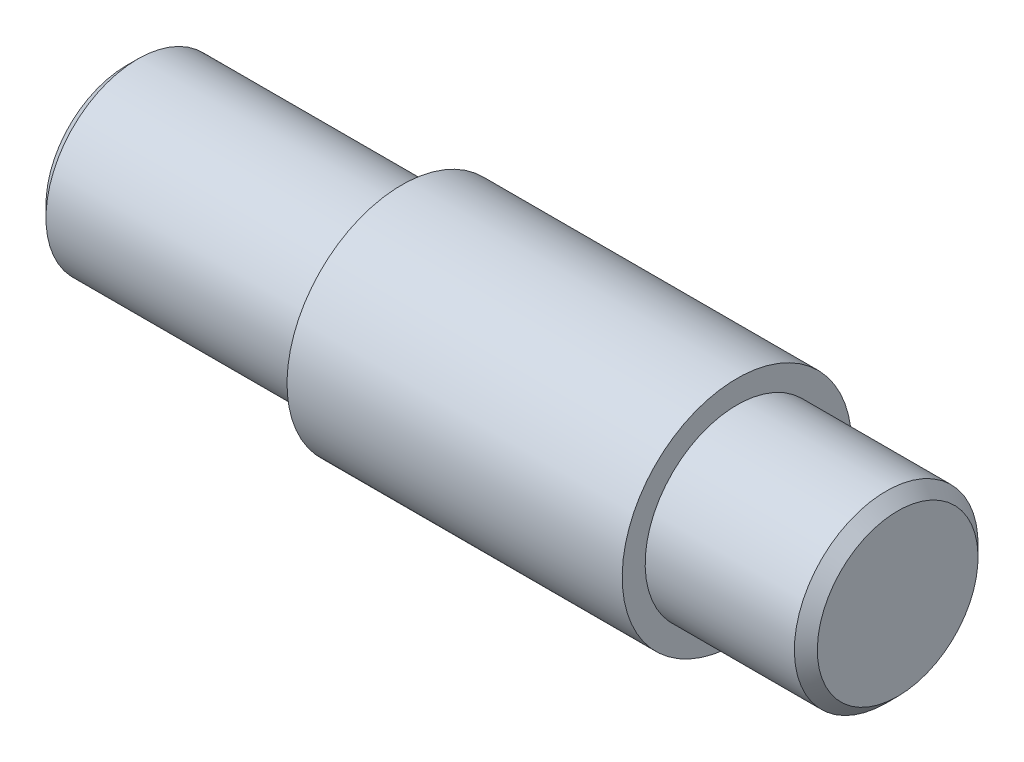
ISO-10303-21;
HEADER;
FILE_DESCRIPTION(('STEP AP214'),'2;1');
FILE_NAME('part.step','',(''),(''),'','','');
FILE_SCHEMA(('AUTOMOTIVE_DESIGN { 1 0 10303 214 1 1 1 1 }'));
ENDSEC;
DATA;
#1=APPLICATION_CONTEXT('core data for automotive mechanical design processes');
#2=APPLICATION_PROTOCOL_DEFINITION('international standard','automotive_design',2000,#1);
#3=PRODUCT_CONTEXT('',#1,'mechanical');
#4=PRODUCT('Part','Part','',(#3));
#5=PRODUCT_RELATED_PRODUCT_CATEGORY('part','',(#4));
#6=PRODUCT_DEFINITION_FORMATION('','',#4);
#7=PRODUCT_DEFINITION_CONTEXT('part definition',#1,'design');
#8=PRODUCT_DEFINITION('design','',#6,#7);
#9=PRODUCT_DEFINITION_SHAPE('','',#8);
#10=(LENGTH_UNIT() NAMED_UNIT(*) SI_UNIT(.MILLI.,.METRE.));
#11=(NAMED_UNIT(*) PLANE_ANGLE_UNIT() SI_UNIT($,.RADIAN.));
#12=(NAMED_UNIT(*) SI_UNIT($,.STERADIAN.) SOLID_ANGLE_UNIT());
#13=UNCERTAINTY_MEASURE_WITH_UNIT(LENGTH_MEASURE(1.E-05),#10,'distance_accuracy_value','');
#14=(GEOMETRIC_REPRESENTATION_CONTEXT(3) GLOBAL_UNCERTAINTY_ASSIGNED_CONTEXT((#13)) GLOBAL_UNIT_ASSIGNED_CONTEXT((#10,
#11,#12)) REPRESENTATION_CONTEXT('',''));
#15=CARTESIAN_POINT('',(0.,0.,0.));
#16=DIRECTION('',(0.,0.,1.));
#17=DIRECTION('',(1.,0.,0.));
#18=AXIS2_PLACEMENT_3D('',#15,#16,#17);
#19=CARTESIAN_POINT('',(0.,2.,0.));
#20=DIRECTION('',(1.,0.,0.));
#21=DIRECTION('',(0.,1.,0.));
#22=AXIS2_PLACEMENT_3D('',#19,#20,#21);
#23=PLANE('',#22);
#24=CARTESIAN_POINT('',(0.,0.,0.));
#25=DIRECTION('',(1.,0.,0.));
#26=DIRECTION('',(0.,1.,0.));
#27=AXIS2_PLACEMENT_3D('',#24,#25,#26);
#28=CIRCLE('',#27,1.75);
#29=CARTESIAN_POINT('',(0.,1.75,0.));
#30=VERTEX_POINT('',#29);
#31=EDGE_CURVE('E37',#30,#30,#28,.F.);
#32=ORIENTED_EDGE('',*,*,#31,.T.);
#33=EDGE_LOOP('',(#32));
#34=FACE_BOUND('',#33,.T.);
#35=CARTESIAN_POINT('',(0.,0.,0.));
#36=DIRECTION('',(-1.,0.,0.));
#37=DIRECTION('',(0.,0.,1.));
#38=AXIS2_PLACEMENT_3D('',#35,#36,#37);
#39=CIRCLE('',#38,0.5);
#40=CARTESIAN_POINT('',(0.,0.,0.5));
#41=VERTEX_POINT('',#40);
#42=EDGE_CURVE('E65',#41,#41,#39,.T.);
#43=ORIENTED_EDGE('',*,*,#42,.F.);
#44=EDGE_LOOP('',(#43));
#45=FACE_BOUND('',#44,.T.);
#46=ADVANCED_FACE('F31',(#34,#45),#23,.F.);
#47=CARTESIAN_POINT('',(16.8,0.,0.));
#48=DIRECTION('',(-1.,0.,0.));
#49=DIRECTION('',(0.,-1.,0.));
#50=AXIS2_PLACEMENT_3D('',#47,#48,#49);
#51=PLANE('',#50);
#52=CARTESIAN_POINT('',(16.8,0.,0.));
#53=DIRECTION('',(-1.,0.,0.));
#54=DIRECTION('',(0.,-1.,0.));
#55=AXIS2_PLACEMENT_3D('',#52,#53,#54);
#56=CIRCLE('',#55,1.74999999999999);
#57=CARTESIAN_POINT('',(16.8,-1.74999999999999,0.));
#58=VERTEX_POINT('',#57);
#59=EDGE_CURVE('E41',#58,#58,#56,.F.);
#60=ORIENTED_EDGE('',*,*,#59,.T.);
#61=EDGE_LOOP('',(#60));
#62=FACE_BOUND('',#61,.T.);
#63=ADVANCED_FACE('F72',(#62),#51,.F.);
#64=CARTESIAN_POINT('',(0.,0.,0.));
#65=DIRECTION('',(-1.,0.,0.));
#66=DIRECTION('',(0.,-1.,0.));
#67=AXIS2_PLACEMENT_3D('',#64,#65,#66);
#68=CYLINDRICAL_SURFACE('',#67,2.);
#69=CARTESIAN_POINT('',(16.55,0.,0.));
#70=DIRECTION('',(-1.,0.,0.));
#71=DIRECTION('',(0.,-1.,0.));
#72=AXIS2_PLACEMENT_3D('',#69,#70,#71);
#73=CIRCLE('',#72,2.);
#74=CARTESIAN_POINT('',(16.55,-2.,0.));
#75=VERTEX_POINT('',#74);
#76=EDGE_CURVE('E45',#75,#75,#73,.T.);
#77=ORIENTED_EDGE('',*,*,#76,.T.);
#78=EDGE_LOOP('',(#77));
#79=FACE_BOUND('',#78,.T.);
#80=CARTESIAN_POINT('',(13.3,0.,0.));
#81=DIRECTION('',(-1.,0.,0.));
#82=DIRECTION('',(0.,-1.,0.));
#83=AXIS2_PLACEMENT_3D('',#80,#81,#82);
#84=CIRCLE('',#83,2.);
#85=CARTESIAN_POINT('',(13.3,-2.,0.));
#86=VERTEX_POINT('',#85);
#87=EDGE_CURVE('E50',#86,#86,#84,.T.);
#88=ORIENTED_EDGE('',*,*,#87,.F.);
#89=EDGE_LOOP('',(#88));
#90=FACE_BOUND('',#89,.T.);
#91=ADVANCED_FACE('F76',(#79,#90),#68,.T.);
#92=CARTESIAN_POINT('',(13.3,2.,0.));
#93=DIRECTION('',(-1.,0.,0.));
#94=DIRECTION('',(0.,-1.,0.));
#95=AXIS2_PLACEMENT_3D('',#92,#93,#94);
#96=PLANE('',#95);
#97=CARTESIAN_POINT('',(13.3,0.,0.));
#98=DIRECTION('',(-1.,0.,0.));
#99=DIRECTION('',(0.,-1.,0.));
#100=AXIS2_PLACEMENT_3D('',#97,#98,#99);
#101=CIRCLE('',#100,2.5);
#102=CARTESIAN_POINT('',(13.3,-2.5,0.));
#103=VERTEX_POINT('',#102);
#104=EDGE_CURVE('E53',#103,#103,#101,.T.);
#105=ORIENTED_EDGE('',*,*,#104,.F.);
#106=EDGE_LOOP('',(#105));
#107=FACE_BOUND('',#106,.T.);
#108=ORIENTED_EDGE('',*,*,#87,.T.);
#109=EDGE_LOOP('',(#108));
#110=FACE_BOUND('',#109,.T.);
#111=ADVANCED_FACE('F81',(#107,#110),#96,.F.);
#112=CARTESIAN_POINT('',(0.,0.,0.));
#113=DIRECTION('',(-1.,0.,0.));
#114=DIRECTION('',(0.,-1.,0.));
#115=AXIS2_PLACEMENT_3D('',#112,#113,#114);
#116=CYLINDRICAL_SURFACE('',#115,2.5);
#117=CARTESIAN_POINT('',(6.,0.,0.));
#118=DIRECTION('',(-1.,0.,0.));
#119=DIRECTION('',(0.,-1.,0.));
#120=AXIS2_PLACEMENT_3D('',#117,#118,#119);
#121=CIRCLE('',#120,2.5);
#122=CARTESIAN_POINT('',(6.,-2.5,0.));
#123=VERTEX_POINT('',#122);
#124=EDGE_CURVE('E56',#123,#123,#121,.T.);
#125=ORIENTED_EDGE('',*,*,#124,.F.);
#126=EDGE_LOOP('',(#125));
#127=FACE_BOUND('',#126,.T.);
#128=ORIENTED_EDGE('',*,*,#104,.T.);
#129=EDGE_LOOP('',(#128));
#130=FACE_BOUND('',#129,.T.);
#131=ADVANCED_FACE('F87',(#127,#130),#116,.T.);
#132=CARTESIAN_POINT('',(6.,2.5,0.));
#133=DIRECTION('',(1.,0.,0.));
#134=DIRECTION('',(0.,1.,0.));
#135=AXIS2_PLACEMENT_3D('',#132,#133,#134);
#136=PLANE('',#135);
#137=CARTESIAN_POINT('',(6.,0.,0.));
#138=DIRECTION('',(-1.,0.,0.));
#139=DIRECTION('',(0.,-1.,0.));
#140=AXIS2_PLACEMENT_3D('',#137,#138,#139);
#141=CIRCLE('',#140,2.);
#142=CARTESIAN_POINT('',(6.,-2.,0.));
#143=VERTEX_POINT('',#142);
#144=EDGE_CURVE('E59',#143,#143,#141,.T.);
#145=ORIENTED_EDGE('',*,*,#144,.F.);
#146=EDGE_LOOP('',(#145));
#147=FACE_BOUND('',#146,.T.);
#148=ORIENTED_EDGE('',*,*,#124,.T.);
#149=EDGE_LOOP('',(#148));
#150=FACE_BOUND('',#149,.T.);
#151=ADVANCED_FACE('F91',(#147,#150),#136,.F.);
#152=CARTESIAN_POINT('',(0.,0.,0.));
#153=DIRECTION('',(-1.,0.,0.));
#154=DIRECTION('',(0.,-1.,0.));
#155=AXIS2_PLACEMENT_3D('',#152,#153,#154);
#156=CYLINDRICAL_SURFACE('',#155,2.);
#157=CARTESIAN_POINT('',(0.25,0.,0.));
#158=DIRECTION('',(1.,0.,0.));
#159=DIRECTION('',(0.,1.,0.));
#160=AXIS2_PLACEMENT_3D('',#157,#158,#159);
#161=CIRCLE('',#160,2.);
#162=CARTESIAN_POINT('',(0.25,2.,0.));
#163=VERTEX_POINT('',#162);
#164=EDGE_CURVE('E10',#163,#163,#161,.T.);
#165=ORIENTED_EDGE('',*,*,#164,.T.);
#166=EDGE_LOOP('',(#165));
#167=FACE_BOUND('',#166,.T.);
#168=ORIENTED_EDGE('',*,*,#144,.T.);
#169=EDGE_LOOP('',(#168));
#170=FACE_BOUND('',#169,.T.);
#171=ADVANCED_FACE('F95',(#167,#170),#156,.T.);
#172=CARTESIAN_POINT('',(1.,0.,0.));
#173=DIRECTION('',(-1.,0.,0.));
#174=DIRECTION('',(0.,0.,1.));
#175=AXIS2_PLACEMENT_3D('',#172,#173,#174);
#176=CYLINDRICAL_SURFACE('',#175,0.5);
#177=CARTESIAN_POINT('',(1.,0.,0.));
#178=DIRECTION('',(-1.,0.,0.));
#179=DIRECTION('',(0.,0.,1.));
#180=AXIS2_PLACEMENT_3D('',#177,#178,#179);
#181=CIRCLE('',#180,0.5);
#182=CARTESIAN_POINT('',(1.,0.,0.5));
#183=VERTEX_POINT('',#182);
#184=EDGE_CURVE('E62',#183,#183,#181,.T.);
#185=ORIENTED_EDGE('',*,*,#184,.F.);
#186=EDGE_LOOP('',(#185));
#187=FACE_BOUND('',#186,.T.);
#188=ORIENTED_EDGE('',*,*,#42,.T.);
#189=EDGE_LOOP('',(#188));
#190=FACE_BOUND('',#189,.T.);
#191=ADVANCED_FACE('F69',(#187,#190),#176,.F.);
#192=CARTESIAN_POINT('',(1.,0.,0.));
#193=DIRECTION('',(-1.,0.,0.));
#194=DIRECTION('',(0.,0.,1.));
#195=AXIS2_PLACEMENT_3D('',#192,#193,#194);
#196=PLANE('',#195);
#197=ORIENTED_EDGE('',*,*,#184,.T.);
#198=EDGE_LOOP('',(#197));
#199=FACE_BOUND('',#198,.T.);
#200=ADVANCED_FACE('F101',(#199),#196,.T.);
#201=CARTESIAN_POINT('',(16.55,0.,0.));
#202=DIRECTION('',(-1.,0.,0.));
#203=DIRECTION('',(0.,-1.,0.));
#204=AXIS2_PLACEMENT_3D('',#201,#202,#203);
#205=CONICAL_SURFACE('',#204,2.,0.785398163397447);
#206=ORIENTED_EDGE('',*,*,#59,.F.);
#207=EDGE_LOOP('',(#206));
#208=FACE_BOUND('',#207,.T.);
#209=ORIENTED_EDGE('',*,*,#76,.F.);
#210=EDGE_LOOP('',(#209));
#211=FACE_BOUND('',#210,.T.);
#212=ADVANCED_FACE('F105',(#208,#211),#205,.T.);
#213=CARTESIAN_POINT('',(0.,0.,0.));
#214=DIRECTION('',(1.,0.,0.));
#215=DIRECTION('',(0.,1.,0.));
#216=AXIS2_PLACEMENT_3D('',#213,#214,#215);
#217=CONICAL_SURFACE('',#216,1.75,0.785398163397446);
#218=ORIENTED_EDGE('',*,*,#164,.F.);
#219=EDGE_LOOP('',(#218));
#220=FACE_BOUND('',#219,.T.);
#221=ORIENTED_EDGE('',*,*,#31,.F.);
#222=EDGE_LOOP('',(#221));
#223=FACE_BOUND('',#222,.T.);
#224=ADVANCED_FACE('F109',(#220,#223),#217,.T.);
#225=CLOSED_SHELL('',(#46,#63,#91,#111,#131,#151,#171,#191,#200,#212,#224));
#226=MANIFOLD_SOLID_BREP('B2',#225);
#227=ADVANCED_BREP_SHAPE_REPRESENTATION('',(#18,#226),#14);
#228=SHAPE_DEFINITION_REPRESENTATION(#9,#227);
ENDSEC;
END-ISO-10303-21;
